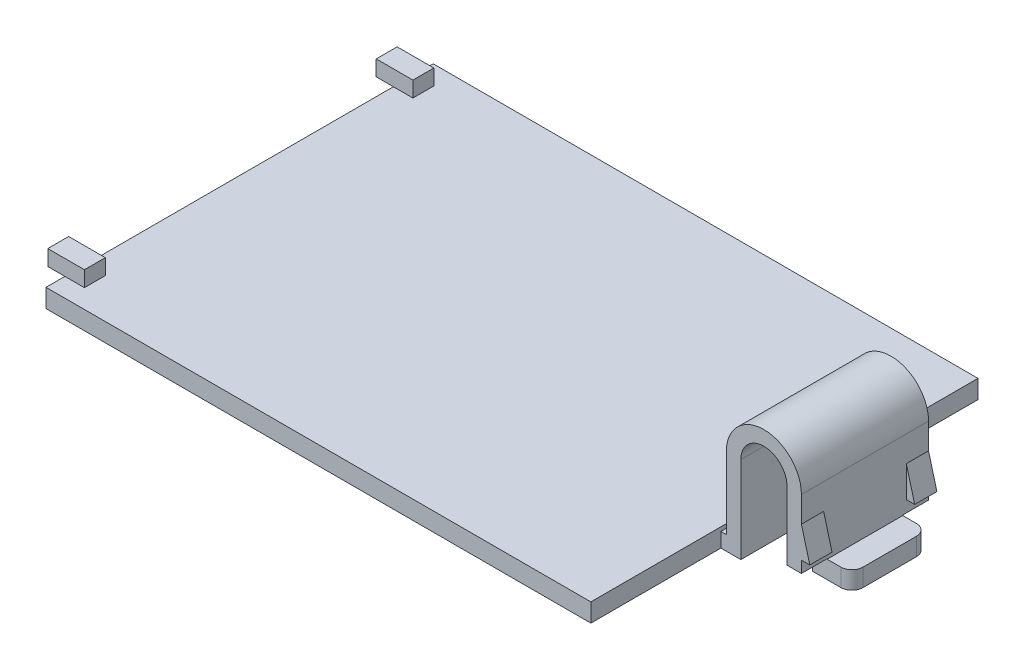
from build123d import *

# Parameters (mm, degrees)
ESQUISSE1_W             = 49.03
ESQUISSE1_H             = 34.84
EXTRUSION1_DEPTH        = 1.66
ESQUISSE2_W             = 3.3
ESQUISSE2_H             = 1.88
EXTRUSION2_DEPTH        = 1.4
EXTRU_MINCE1_DEPTH      = 5.72
EXTRUSION3_DEPTH        = 1.6
ENL_V_MAT_EXTRU_1_REACH = 63.413
ESQUISSE6_W             = 2.32
ESQUISSE6_H             = 1.643869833
EXTRUSION4_DEPTH        = 2


with BuildPart() as part:
    # Esquisse1 → Extrusion1 (new body)
    with BuildSketch(Plane(origin=(0, 0, 0), x_dir=(1, 0, 0), z_dir=(0, 1, 0))):
        with Locations((-24.515, 0)):
            Rectangle(ESQUISSE1_W, ESQUISSE1_H)
    extrude(amount=EXTRUSION1_DEPTH)

    # Esquisse2 → Extrusion2 (add)
    with BuildSketch(Plane(origin=(0, 1.66, 0), x_dir=(-1, 0, 0), z_dir=(0, 1, 0))):
        with Locations((48.921540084, 14.78)):
            Rectangle(ESQUISSE2_W, ESQUISSE2_H)
        with Locations((48.921540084, -14.78)):
            Rectangle(ESQUISSE2_W, ESQUISSE2_H)
    extrude(amount=EXTRUSION2_DEPTH)

    # Esquisse3 → Extru.-Mince1 (add, symmetric)
    with BuildSketch(Plane.XY):
        with BuildLine():
            Line((0, 0), (1.798570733, 0))
            Line((1.798570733, 0), (1.798570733, 7.8))
            ThreePointArc((1.798570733, 7.8), (3.87383057, 9.875259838), (5.949090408, 7.8))
            Line((5.949090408, 7.8), (5.949090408, 0))
            Line((5.949090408, 0), (7.249090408, 0))
            Line((7.249090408, 0), (7.249090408, 7.8))
            ThreePointArc((7.249090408, 7.8), (3.87383057, 11.175259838), (0.498570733, 7.8))
            Line((0.498570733, 7.8), (0.498570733, 1.3))
            Line((0.498570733, 1.3), (0, 1.3))
            Line((0, 1.3), (0, 0))
        make_face()
    extrude(amount=EXTRU_MINCE1_DEPTH, both=True)

    # Esquisse5 → Extrusion3 (add)
    with BuildSketch(Plane(origin=(0, 0, 0), x_dir=(1, 0, 0), z_dir=(0, 1, 0))):
        with BuildLine():
            Line((7.249090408, 3.4), (8.475204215, 3.4))
            ThreePointArc((8.475204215, 3.4), (9.182310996, 3.107106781), (9.475204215, 2.4))
            Line((9.475204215, 2.4), (9.475204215, -2.4))
            ThreePointArc((9.475204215, -2.4), (9.182310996, -3.107106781), (8.475204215, -3.4))
            Line((8.475204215, -3.4), (7.249090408, -3.4))
            Line((7.249090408, -3.4), (7.249090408, 3.4))
        make_face()
    extrude(amount=EXTRUSION3_DEPTH)

    # Esquisse6 → Enl_v. mat.-Extru.1 (cut, up to next)
    with BuildSketch(Plane(origin=(7.249090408, 0, 0), x_dir=(0, 0, -1), z_dir=(1, 0, 0)), mode=Mode.PRIVATE) as enl_v_mat_extru_1_sk1:
        with Locations((4.56, 0.821934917)):
            Rectangle(ESQUISSE6_W, ESQUISSE6_H)
    enl_v_mat_extru_1_tool1 = extrude(enl_v_mat_extru_1_sk1.sketch, amount=-ENL_V_MAT_EXTRU_1_REACH, mode=Mode.PRIVATE) & part.part
    # Esquisse6 → Enl_v. mat.-Extru.1 (cut, up to next)
    with BuildSketch(Plane(origin=(7.249090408, 0, 0), x_dir=(0, 0, -1), z_dir=(1, 0, 0)), mode=Mode.PRIVATE) as enl_v_mat_extru_1_sk2:
        with Locations((-4.56, 0.821934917)):
            Rectangle(ESQUISSE6_W, ESQUISSE6_H)
    enl_v_mat_extru_1_tool2 = extrude(enl_v_mat_extru_1_sk2.sketch, amount=-ENL_V_MAT_EXTRU_1_REACH, mode=Mode.PRIVATE) & part.part
    add(enl_v_mat_extru_1_tool1.solids().sort_by_distance((7.24909, 0.821935, -4.56))[0], mode=Mode.SUBTRACT)
    add(enl_v_mat_extru_1_tool2.solids().sort_by_distance((7.24909, 0.821935, 4.56))[0], mode=Mode.SUBTRACT)

    # Esquisse7 → Extrusion4 (add)
    with BuildSketch(Plane(origin=(0, 0, -5.72), x_dir=(-1, 0, 0), z_dir=(0, 0, -1))):
        Polygon((-7.249090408, 2.685388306), (-8.001774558, 2.685388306), (-7.249090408, 5.486411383), align=None)
    extrusion4 = extrude(amount=-EXTRUSION4_DEPTH)

    # Sym_trie1: Extrusion4 across plane
    add(extrusion4.mirror(Plane.XY))


solid = part.part
